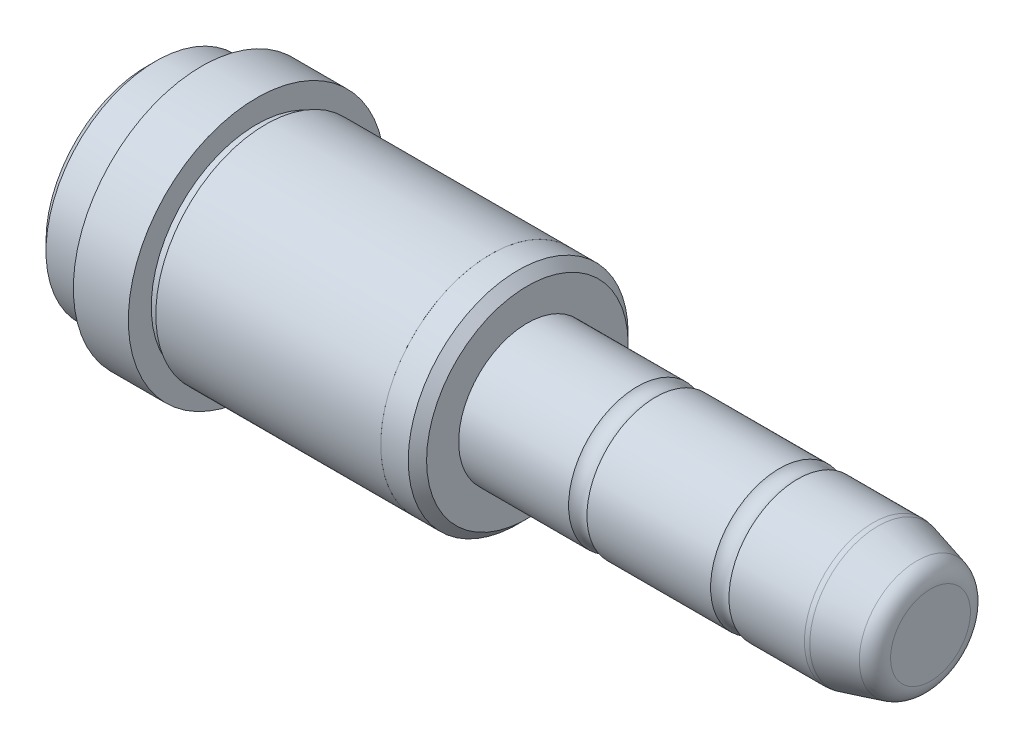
ISO-10303-21;
HEADER;
FILE_DESCRIPTION(('STEP AP214'),'2;1');
FILE_NAME('part.step','',(''),(''),'','','');
FILE_SCHEMA(('AUTOMOTIVE_DESIGN { 1 0 10303 214 1 1 1 1 }'));
ENDSEC;
DATA;
#1=APPLICATION_CONTEXT('core data for automotive mechanical design processes');
#2=APPLICATION_PROTOCOL_DEFINITION('international standard','automotive_design',2000,#1);
#3=PRODUCT_CONTEXT('',#1,'mechanical');
#4=PRODUCT('Part','Part','',(#3));
#5=PRODUCT_RELATED_PRODUCT_CATEGORY('part','',(#4));
#6=PRODUCT_DEFINITION_FORMATION('','',#4);
#7=PRODUCT_DEFINITION_CONTEXT('part definition',#1,'design');
#8=PRODUCT_DEFINITION('design','',#6,#7);
#9=PRODUCT_DEFINITION_SHAPE('','',#8);
#10=(LENGTH_UNIT() NAMED_UNIT(*) SI_UNIT(.MILLI.,.METRE.));
#11=(NAMED_UNIT(*) PLANE_ANGLE_UNIT() SI_UNIT($,.RADIAN.));
#12=(NAMED_UNIT(*) SI_UNIT($,.STERADIAN.) SOLID_ANGLE_UNIT());
#13=UNCERTAINTY_MEASURE_WITH_UNIT(LENGTH_MEASURE(1.E-05),#10,'distance_accuracy_value','');
#14=(GEOMETRIC_REPRESENTATION_CONTEXT(3) GLOBAL_UNCERTAINTY_ASSIGNED_CONTEXT((#13)) GLOBAL_UNIT_ASSIGNED_CONTEXT((#10,
#11,#12)) REPRESENTATION_CONTEXT('',''));
#15=CARTESIAN_POINT('',(0.,0.,0.));
#16=DIRECTION('',(0.,0.,1.));
#17=DIRECTION('',(1.,0.,0.));
#18=AXIS2_PLACEMENT_3D('',#15,#16,#17);
#19=CARTESIAN_POINT('',(85.55,2.17882543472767,0.));
#20=DIRECTION('',(1.,0.,0.));
#21=DIRECTION('',(0.,0.,-1.));
#22=AXIS2_PLACEMENT_3D('',#19,#20,#21);
#23=PLANE('',#22);
#24=CARTESIAN_POINT('',(85.55,0.,0.));
#25=DIRECTION('',(-1.,0.,0.));
#26=DIRECTION('',(0.,1.,0.));
#27=AXIS2_PLACEMENT_3D('',#24,#25,#26);
#28=CIRCLE('',#27,4.35765086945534);
#29=CARTESIAN_POINT('',(85.55,4.35765086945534,0.));
#30=VERTEX_POINT('',#29);
#31=EDGE_CURVE('E128',#30,#30,#28,.T.);
#32=ORIENTED_EDGE('',*,*,#31,.F.);
#33=EDGE_LOOP('',(#32));
#34=FACE_BOUND('',#33,.T.);
#35=ADVANCED_FACE('F15',(#34),#23,.T.);
#36=CARTESIAN_POINT('',(83.55,0.,0.));
#37=DIRECTION('',(1.,0.,0.));
#38=DIRECTION('',(0.,0.,-1.));
#39=AXIS2_PLACEMENT_3D('',#36,#37,#38);
#40=TOROIDAL_SURFACE('',#39,4.35765086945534,2.);
#41=CARTESIAN_POINT('',(84.0676380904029,0.,0.));
#42=DIRECTION('',(-1.,0.,0.));
#43=DIRECTION('',(0.,1.,0.));
#44=AXIS2_PLACEMENT_3D('',#41,#42,#43);
#45=CIRCLE('',#44,6.28950252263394);
#46=CARTESIAN_POINT('',(84.0676380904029,6.28950252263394,0.));
#47=VERTEX_POINT('',#46);
#48=EDGE_CURVE('E123',#47,#47,#45,.T.);
#49=ORIENTED_EDGE('',*,*,#48,.F.);
#50=EDGE_LOOP('',(#49));
#51=FACE_BOUND('',#50,.T.);
#52=ORIENTED_EDGE('',*,*,#31,.T.);
#53=EDGE_LOOP('',(#52));
#54=FACE_BOUND('',#53,.T.);
#55=ADVANCED_FACE('F135',(#51,#54),#40,.T.);
#56=CARTESIAN_POINT('',(79.8043330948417,0.,0.));
#57=DIRECTION('',(-1.,0.,0.));
#58=DIRECTION('',(0.,0.,1.));
#59=AXIS2_PLACEMENT_3D('',#56,#57,#58);
#60=CONICAL_SURFACE('',#59,7.43185165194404,0.261799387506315);
#61=CARTESIAN_POINT('',(79.8043330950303,0.,0.));
#62=DIRECTION('',(1.,0.,0.));
#63=DIRECTION('',(0.,0.,-1.));
#64=AXIS2_PLACEMENT_3D('',#61,#62,#63);
#65=CIRCLE('',#64,7.43185165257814);
#66=CARTESIAN_POINT('',(79.8043330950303,0.,-7.43185165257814));
#67=VERTEX_POINT('',#66);
#68=EDGE_CURVE('E119',#67,#67,#65,.F.);
#69=ORIENTED_EDGE('',*,*,#68,.F.);
#70=EDGE_LOOP('',(#69));
#71=FACE_BOUND('',#70,.T.);
#72=ORIENTED_EDGE('',*,*,#48,.T.);
#73=EDGE_LOOP('',(#72));
#74=FACE_BOUND('',#73,.T.);
#75=ADVANCED_FACE('F112',(#71,#74),#60,.T.);
#76=CARTESIAN_POINT('',(79.2866950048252,0.,0.));
#77=DIRECTION('',(1.,0.,0.));
#78=DIRECTION('',(0.,0.,-1.));
#79=AXIS2_PLACEMENT_3D('',#76,#77,#78);
#80=TOROIDAL_SURFACE('',#79,5.5,2.);
#81=CARTESIAN_POINT('',(79.2866950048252,0.,0.));
#82=DIRECTION('',(1.,0.,0.));
#83=DIRECTION('',(0.,0.,-1.));
#84=AXIS2_PLACEMENT_3D('',#81,#82,#83);
#85=CIRCLE('',#84,7.5);
#86=CARTESIAN_POINT('',(79.2866950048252,0.,-7.5));
#87=VERTEX_POINT('',#86);
#88=EDGE_CURVE('E122',#87,#87,#85,.F.);
#89=ORIENTED_EDGE('',*,*,#88,.F.);
#90=EDGE_LOOP('',(#89));
#91=FACE_BOUND('',#90,.T.);
#92=ORIENTED_EDGE('',*,*,#68,.T.);
#93=EDGE_LOOP('',(#92));
#94=FACE_BOUND('',#93,.T.);
#95=ADVANCED_FACE('F107',(#91,#94),#80,.T.);
#96=CARTESIAN_POINT('',(0.,5.492375,0.));
#97=DIRECTION('',(-1.,0.,0.));
#98=DIRECTION('',(0.,0.,1.));
#99=AXIS2_PLACEMENT_3D('',#96,#97,#98);
#100=PLANE('',#99);
#101=CARTESIAN_POINT('',(-4.48723089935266E-10,0.,0.));
#102=DIRECTION('',(1.,0.,0.));
#103=DIRECTION('',(0.,0.,-1.));
#104=AXIS2_PLACEMENT_3D('',#101,#102,#103);
#105=CIRCLE('',#104,10.9847500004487);
#106=CARTESIAN_POINT('',(-4.48723089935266E-10,0.,-10.9847500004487));
#107=VERTEX_POINT('',#106);
#108=EDGE_CURVE('E19',#107,#107,#105,.T.);
#109=ORIENTED_EDGE('',*,*,#108,.F.);
#110=EDGE_LOOP('',(#109));
#111=FACE_BOUND('',#110,.T.);
#112=ADVANCED_FACE('F103',(#111),#100,.T.);
#113=CARTESIAN_POINT('',(75.1683475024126,0.,0.));
#114=DIRECTION('',(1.,0.,0.));
#115=DIRECTION('',(0.,0.,-1.));
#116=AXIS2_PLACEMENT_3D('',#113,#114,#115);
#117=CYLINDRICAL_SURFACE('',#116,7.5);
#118=CARTESIAN_POINT('',(71.05,0.,0.));
#119=DIRECTION('',(1.,0.,0.));
#120=DIRECTION('',(0.,0.,-1.));
#121=AXIS2_PLACEMENT_3D('',#118,#119,#120);
#122=CIRCLE('',#121,7.50000000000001);
#123=CARTESIAN_POINT('',(71.05,0.,-7.50000000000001));
#124=VERTEX_POINT('',#123);
#125=EDGE_CURVE('E76',#124,#124,#122,.T.);
#126=ORIENTED_EDGE('',*,*,#125,.T.);
#127=EDGE_LOOP('',(#126));
#128=FACE_BOUND('',#127,.T.);
#129=ORIENTED_EDGE('',*,*,#88,.T.);
#130=EDGE_LOOP('',(#129));
#131=FACE_BOUND('',#130,.T.);
#132=ADVANCED_FACE('F99',(#128,#131),#117,.T.);
#133=CARTESIAN_POINT('',(1.00000000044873,0.,0.));
#134=DIRECTION('',(1.,0.,0.));
#135=DIRECTION('',(0.,0.,-1.));
#136=AXIS2_PLACEMENT_3D('',#133,#134,#135);
#137=CONICAL_SURFACE('',#136,11.9847499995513,0.785398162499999);
#138=ORIENTED_EDGE('',*,*,#108,.T.);
#139=EDGE_LOOP('',(#138));
#140=FACE_BOUND('',#139,.T.);
#141=CARTESIAN_POINT('',(1.,0.,0.));
#142=DIRECTION('',(1.,0.,0.));
#143=DIRECTION('',(0.,0.,-1.));
#144=AXIS2_PLACEMENT_3D('',#141,#142,#143);
#145=CIRCLE('',#144,11.98475);
#146=CARTESIAN_POINT('',(1.,0.,-11.98475));
#147=VERTEX_POINT('',#146);
#148=EDGE_CURVE('E71',#147,#147,#145,.T.);
#149=ORIENTED_EDGE('',*,*,#148,.F.);
#150=EDGE_LOOP('',(#149));
#151=FACE_BOUND('',#150,.T.);
#152=ADVANCED_FACE('F94',(#140,#151),#137,.T.);
#153=CARTESIAN_POINT('',(70.05,0.,0.));
#154=DIRECTION('',(1.,0.,0.));
#155=DIRECTION('',(0.,0.,-1.));
#156=AXIS2_PLACEMENT_3D('',#153,#154,#155);
#157=TOROIDAL_SURFACE('',#156,8.6180339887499,1.5);
#158=CARTESIAN_POINT('',(69.05,0.,0.));
#159=DIRECTION('',(1.,0.,0.));
#160=DIRECTION('',(0.,0.,-1.));
#161=AXIS2_PLACEMENT_3D('',#158,#159,#160);
#162=CIRCLE('',#161,7.5);
#163=CARTESIAN_POINT('',(69.05,0.,-7.5));
#164=VERTEX_POINT('',#163);
#165=EDGE_CURVE('E65',#164,#164,#162,.F.);
#166=ORIENTED_EDGE('',*,*,#165,.F.);
#167=EDGE_LOOP('',(#166));
#168=FACE_BOUND('',#167,.T.);
#169=ORIENTED_EDGE('',*,*,#125,.F.);
#170=EDGE_LOOP('',(#169));
#171=FACE_BOUND('',#170,.T.);
#172=ADVANCED_FACE('F89',(#168,#171),#157,.F.);
#173=CARTESIAN_POINT('',(3.,0.,0.));
#174=DIRECTION('',(1.,0.,0.));
#175=DIRECTION('',(0.,0.,-1.));
#176=AXIS2_PLACEMENT_3D('',#173,#174,#175);
#177=CYLINDRICAL_SURFACE('',#176,11.98475);
#178=ORIENTED_EDGE('',*,*,#148,.T.);
#179=EDGE_LOOP('',(#178));
#180=FACE_BOUND('',#179,.T.);
#181=CARTESIAN_POINT('',(5.,0.,0.));
#182=DIRECTION('',(1.,0.,0.));
#183=DIRECTION('',(0.,0.,-1.));
#184=AXIS2_PLACEMENT_3D('',#181,#182,#183);
#185=CIRCLE('',#184,11.98475);
#186=CARTESIAN_POINT('',(5.,0.,-11.98475));
#187=VERTEX_POINT('',#186);
#188=EDGE_CURVE('E63',#187,#187,#185,.T.);
#189=ORIENTED_EDGE('',*,*,#188,.F.);
#190=EDGE_LOOP('',(#189));
#191=FACE_BOUND('',#190,.T.);
#192=ADVANCED_FACE('F93',(#180,#191),#177,.T.);
#193=CARTESIAN_POINT('',(62.3,0.,0.));
#194=DIRECTION('',(1.,0.,0.));
#195=DIRECTION('',(0.,0.,-1.));
#196=AXIS2_PLACEMENT_3D('',#193,#194,#195);
#197=CYLINDRICAL_SURFACE('',#196,7.5);
#198=CARTESIAN_POINT('',(55.55,0.,0.));
#199=DIRECTION('',(1.,0.,0.));
#200=DIRECTION('',(0.,0.,-1.));
#201=AXIS2_PLACEMENT_3D('',#198,#199,#200);
#202=CIRCLE('',#201,7.5);
#203=CARTESIAN_POINT('',(55.55,0.,-7.5));
#204=VERTEX_POINT('',#203);
#205=EDGE_CURVE('E62',#204,#204,#202,.T.);
#206=ORIENTED_EDGE('',*,*,#205,.T.);
#207=EDGE_LOOP('',(#206));
#208=FACE_BOUND('',#207,.T.);
#209=ORIENTED_EDGE('',*,*,#165,.T.);
#210=EDGE_LOOP('',(#209));
#211=FACE_BOUND('',#210,.T.);
#212=ADVANCED_FACE('F224',(#208,#211),#197,.T.);
#213=CARTESIAN_POINT('',(5.,11.742375,0.));
#214=DIRECTION('',(1.,0.,0.));
#215=DIRECTION('',(0.,0.,-1.));
#216=AXIS2_PLACEMENT_3D('',#213,#214,#215);
#217=PLANE('',#216);
#218=CARTESIAN_POINT('',(5.,0.,0.));
#219=DIRECTION('',(1.,0.,0.));
#220=DIRECTION('',(0.,0.,-1.));
#221=AXIS2_PLACEMENT_3D('',#218,#219,#220);
#222=CIRCLE('',#221,11.5);
#223=CARTESIAN_POINT('',(5.,0.,-11.5));
#224=VERTEX_POINT('',#223);
#225=EDGE_CURVE('E60',#224,#224,#222,.T.);
#226=ORIENTED_EDGE('',*,*,#225,.F.);
#227=EDGE_LOOP('',(#226));
#228=FACE_BOUND('',#227,.T.);
#229=ORIENTED_EDGE('',*,*,#188,.T.);
#230=EDGE_LOOP('',(#229));
#231=FACE_BOUND('',#230,.T.);
#232=ADVANCED_FACE('F203',(#228,#231),#217,.T.);
#233=CARTESIAN_POINT('',(54.55,0.,0.));
#234=DIRECTION('',(1.,0.,0.));
#235=DIRECTION('',(0.,0.,-1.));
#236=AXIS2_PLACEMENT_3D('',#233,#234,#235);
#237=TOROIDAL_SURFACE('',#236,8.6180339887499,1.5);
#238=CARTESIAN_POINT('',(53.55,0.,0.));
#239=DIRECTION('',(1.,0.,0.));
#240=DIRECTION('',(0.,0.,-1.));
#241=AXIS2_PLACEMENT_3D('',#238,#239,#240);
#242=CIRCLE('',#241,7.5);
#243=CARTESIAN_POINT('',(53.55,0.,-7.5));
#244=VERTEX_POINT('',#243);
#245=EDGE_CURVE('E59',#244,#244,#242,.F.);
#246=ORIENTED_EDGE('',*,*,#245,.F.);
#247=EDGE_LOOP('',(#246));
#248=FACE_BOUND('',#247,.T.);
#249=ORIENTED_EDGE('',*,*,#205,.F.);
#250=EDGE_LOOP('',(#249));
#251=FACE_BOUND('',#250,.T.);
#252=ADVANCED_FACE('F198',(#248,#251),#237,.F.);
#253=CARTESIAN_POINT('',(5.5,0.,0.));
#254=DIRECTION('',(1.,0.,0.));
#255=DIRECTION('',(0.,0.,-1.));
#256=AXIS2_PLACEMENT_3D('',#253,#254,#255);
#257=CYLINDRICAL_SURFACE('',#256,11.5);
#258=ORIENTED_EDGE('',*,*,#225,.T.);
#259=EDGE_LOOP('',(#258));
#260=FACE_BOUND('',#259,.T.);
#261=CARTESIAN_POINT('',(6.,0.,0.));
#262=DIRECTION('',(1.,0.,0.));
#263=DIRECTION('',(0.,0.,-1.));
#264=AXIS2_PLACEMENT_3D('',#261,#262,#263);
#265=CIRCLE('',#264,11.5);
#266=CARTESIAN_POINT('',(6.,0.,-11.5));
#267=VERTEX_POINT('',#266);
#268=EDGE_CURVE('E56',#267,#267,#265,.T.);
#269=ORIENTED_EDGE('',*,*,#268,.F.);
#270=EDGE_LOOP('',(#269));
#271=FACE_BOUND('',#270,.T.);
#272=ADVANCED_FACE('F194',(#260,#271),#257,.T.);
#273=CARTESIAN_POINT('',(47.55,0.,0.));
#274=DIRECTION('',(1.,0.,0.));
#275=DIRECTION('',(0.,0.,-1.));
#276=AXIS2_PLACEMENT_3D('',#273,#274,#275);
#277=CYLINDRICAL_SURFACE('',#276,7.5);
#278=CARTESIAN_POINT('',(41.55,0.,0.));
#279=DIRECTION('',(1.,0.,0.));
#280=DIRECTION('',(0.,0.,-1.));
#281=AXIS2_PLACEMENT_3D('',#278,#279,#280);
#282=CIRCLE('',#281,7.5);
#283=CARTESIAN_POINT('',(41.55,0.,-7.5));
#284=VERTEX_POINT('',#283);
#285=EDGE_CURVE('E53',#284,#284,#282,.F.);
#286=ORIENTED_EDGE('',*,*,#285,.F.);
#287=EDGE_LOOP('',(#286));
#288=FACE_BOUND('',#287,.T.);
#289=ORIENTED_EDGE('',*,*,#245,.T.);
#290=EDGE_LOOP('',(#289));
#291=FACE_BOUND('',#290,.T.);
#292=ADVANCED_FACE('F190',(#288,#291),#277,.T.);
#293=CARTESIAN_POINT('',(6.,12.75,0.));
#294=DIRECTION('',(-1.,0.,0.));
#295=DIRECTION('',(0.,0.,1.));
#296=AXIS2_PLACEMENT_3D('',#293,#294,#295);
#297=PLANE('',#296);
#298=ORIENTED_EDGE('',*,*,#268,.T.);
#299=EDGE_LOOP('',(#298));
#300=FACE_BOUND('',#299,.T.);
#301=CARTESIAN_POINT('',(6.,0.,0.));
#302=DIRECTION('',(1.,0.,0.));
#303=DIRECTION('',(0.,0.,-1.));
#304=AXIS2_PLACEMENT_3D('',#301,#302,#303);
#305=CIRCLE('',#304,14.);
#306=CARTESIAN_POINT('',(6.,0.,-14.));
#307=VERTEX_POINT('',#306);
#308=EDGE_CURVE('E50',#307,#307,#305,.T.);
#309=ORIENTED_EDGE('',*,*,#308,.F.);
#310=EDGE_LOOP('',(#309));
#311=FACE_BOUND('',#310,.T.);
#312=ADVANCED_FACE('F186',(#300,#311),#297,.T.);
#313=CARTESIAN_POINT('',(41.55,9.25,0.));
#314=DIRECTION('',(1.,0.,0.));
#315=DIRECTION('',(0.,0.,-1.));
#316=AXIS2_PLACEMENT_3D('',#313,#314,#315);
#317=PLANE('',#316);
#318=ORIENTED_EDGE('',*,*,#285,.T.);
#319=EDGE_LOOP('',(#318));
#320=FACE_BOUND('',#319,.T.);
#321=CARTESIAN_POINT('',(41.5500000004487,0.,0.));
#322=DIRECTION('',(-1.,0.,0.));
#323=DIRECTION('',(0.,0.,1.));
#324=AXIS2_PLACEMENT_3D('',#321,#322,#323);
#325=CIRCLE('',#324,11.0000000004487);
#326=CARTESIAN_POINT('',(41.5500000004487,0.,11.0000000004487));
#327=VERTEX_POINT('',#326);
#328=EDGE_CURVE('E47',#327,#327,#325,.T.);
#329=ORIENTED_EDGE('',*,*,#328,.F.);
#330=EDGE_LOOP('',(#329));
#331=FACE_BOUND('',#330,.T.);
#332=ADVANCED_FACE('F182',(#320,#331),#317,.T.);
#333=CARTESIAN_POINT('',(9.,0.,0.));
#334=DIRECTION('',(1.,0.,0.));
#335=DIRECTION('',(0.,0.,-1.));
#336=AXIS2_PLACEMENT_3D('',#333,#334,#335);
#337=CYLINDRICAL_SURFACE('',#336,14.);
#338=ORIENTED_EDGE('',*,*,#308,.T.);
#339=EDGE_LOOP('',(#338));
#340=FACE_BOUND('',#339,.T.);
#341=CARTESIAN_POINT('',(12.,0.,0.));
#342=DIRECTION('',(1.,0.,0.));
#343=DIRECTION('',(0.,0.,-1.));
#344=AXIS2_PLACEMENT_3D('',#341,#342,#343);
#345=CIRCLE('',#344,14.);
#346=CARTESIAN_POINT('',(12.,0.,-14.));
#347=VERTEX_POINT('',#346);
#348=EDGE_CURVE('E44',#347,#347,#345,.T.);
#349=ORIENTED_EDGE('',*,*,#348,.F.);
#350=EDGE_LOOP('',(#349));
#351=FACE_BOUND('',#350,.T.);
#352=ADVANCED_FACE('F178',(#340,#351),#337,.T.);
#353=CARTESIAN_POINT('',(40.5499999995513,0.,0.));
#354=DIRECTION('',(-1.,0.,0.));
#355=DIRECTION('',(0.,0.,1.));
#356=AXIS2_PLACEMENT_3D('',#353,#354,#355);
#357=CONICAL_SURFACE('',#356,11.9999999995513,0.785398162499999);
#358=CARTESIAN_POINT('',(40.55,0.,0.));
#359=DIRECTION('',(1.,0.,0.));
#360=DIRECTION('',(0.,0.,-1.));
#361=AXIS2_PLACEMENT_3D('',#358,#359,#360);
#362=CIRCLE('',#361,12.);
#363=CARTESIAN_POINT('',(40.55,0.,-12.));
#364=VERTEX_POINT('',#363);
#365=EDGE_CURVE('E43',#364,#364,#362,.F.);
#366=ORIENTED_EDGE('',*,*,#365,.F.);
#367=EDGE_LOOP('',(#366));
#368=FACE_BOUND('',#367,.T.);
#369=ORIENTED_EDGE('',*,*,#328,.T.);
#370=EDGE_LOOP('',(#369));
#371=FACE_BOUND('',#370,.T.);
#372=ADVANCED_FACE('F174',(#368,#371),#357,.T.);
#373=CARTESIAN_POINT('',(12.,12.75,0.));
#374=DIRECTION('',(1.,0.,0.));
#375=DIRECTION('',(0.,0.,-1.));
#376=AXIS2_PLACEMENT_3D('',#373,#374,#375);
#377=PLANE('',#376);
#378=CARTESIAN_POINT('',(12.,0.,0.));
#379=DIRECTION('',(1.,0.,0.));
#380=DIRECTION('',(0.,0.,-1.));
#381=AXIS2_PLACEMENT_3D('',#378,#379,#380);
#382=CIRCLE('',#381,11.5);
#383=CARTESIAN_POINT('',(12.,0.,-11.5));
#384=VERTEX_POINT('',#383);
#385=EDGE_CURVE('E40',#384,#384,#382,.T.);
#386=ORIENTED_EDGE('',*,*,#385,.F.);
#387=EDGE_LOOP('',(#386));
#388=FACE_BOUND('',#387,.T.);
#389=ORIENTED_EDGE('',*,*,#348,.T.);
#390=EDGE_LOOP('',(#389));
#391=FACE_BOUND('',#390,.T.);
#392=ADVANCED_FACE('F170',(#388,#391),#377,.T.);
#393=CARTESIAN_POINT('',(39.05,0.,0.));
#394=DIRECTION('',(1.,0.,0.));
#395=DIRECTION('',(0.,0.,-1.));
#396=AXIS2_PLACEMENT_3D('',#393,#394,#395);
#397=CYLINDRICAL_SURFACE('',#396,12.);
#398=CARTESIAN_POINT('',(37.55,0.,0.));
#399=DIRECTION('',(1.,0.,0.));
#400=DIRECTION('',(0.,0.,-1.));
#401=AXIS2_PLACEMENT_3D('',#398,#399,#400);
#402=CIRCLE('',#401,12.);
#403=CARTESIAN_POINT('',(37.55,0.,-12.));
#404=VERTEX_POINT('',#403);
#405=EDGE_CURVE('E37',#404,#404,#402,.F.);
#406=ORIENTED_EDGE('',*,*,#405,.F.);
#407=EDGE_LOOP('',(#406));
#408=FACE_BOUND('',#407,.T.);
#409=ORIENTED_EDGE('',*,*,#365,.T.);
#410=EDGE_LOOP('',(#409));
#411=FACE_BOUND('',#410,.T.);
#412=ADVANCED_FACE('F166',(#408,#411),#397,.T.);
#413=CARTESIAN_POINT('',(12.5,0.,0.));
#414=DIRECTION('',(1.,0.,0.));
#415=DIRECTION('',(0.,0.,-1.));
#416=AXIS2_PLACEMENT_3D('',#413,#414,#415);
#417=CYLINDRICAL_SURFACE('',#416,11.5);
#418=ORIENTED_EDGE('',*,*,#385,.T.);
#419=EDGE_LOOP('',(#418));
#420=FACE_BOUND('',#419,.T.);
#421=CARTESIAN_POINT('',(13.,0.,0.));
#422=DIRECTION('',(1.,0.,0.));
#423=DIRECTION('',(0.,0.,-1.));
#424=AXIS2_PLACEMENT_3D('',#421,#422,#423);
#425=CIRCLE('',#424,11.5);
#426=CARTESIAN_POINT('',(13.,0.,-11.5));
#427=VERTEX_POINT('',#426);
#428=EDGE_CURVE('E28',#427,#427,#425,.T.);
#429=ORIENTED_EDGE('',*,*,#428,.F.);
#430=EDGE_LOOP('',(#429));
#431=FACE_BOUND('',#430,.T.);
#432=ADVANCED_FACE('F162',(#420,#431),#417,.T.);
#433=CARTESIAN_POINT('',(37.55,12.002125,0.));
#434=DIRECTION('',(1.,0.,0.));
#435=DIRECTION('',(0.,0.,-1.));
#436=AXIS2_PLACEMENT_3D('',#433,#434,#435);
#437=PLANE('',#436);
#438=ORIENTED_EDGE('',*,*,#405,.T.);
#439=EDGE_LOOP('',(#438));
#440=FACE_BOUND('',#439,.T.);
#441=CARTESIAN_POINT('',(37.55,0.,0.));
#442=DIRECTION('',(1.,0.,0.));
#443=DIRECTION('',(0.,0.,-1.));
#444=AXIS2_PLACEMENT_3D('',#441,#442,#443);
#445=CIRCLE('',#444,12.00425);
#446=CARTESIAN_POINT('',(37.55,0.,-12.00425));
#447=VERTEX_POINT('',#446);
#448=EDGE_CURVE('E23',#447,#447,#445,.F.);
#449=ORIENTED_EDGE('',*,*,#448,.F.);
#450=EDGE_LOOP('',(#449));
#451=FACE_BOUND('',#450,.T.);
#452=ADVANCED_FACE('F155',(#440,#451),#437,.T.);
#453=CARTESIAN_POINT('',(13.,11.752125,0.));
#454=DIRECTION('',(-1.,0.,0.));
#455=DIRECTION('',(0.,0.,1.));
#456=AXIS2_PLACEMENT_3D('',#453,#454,#455);
#457=PLANE('',#456);
#458=ORIENTED_EDGE('',*,*,#428,.T.);
#459=EDGE_LOOP('',(#458));
#460=FACE_BOUND('',#459,.T.);
#461=CARTESIAN_POINT('',(13.,0.,0.));
#462=DIRECTION('',(1.,0.,0.));
#463=DIRECTION('',(0.,0.,-1.));
#464=AXIS2_PLACEMENT_3D('',#461,#462,#463);
#465=CIRCLE('',#464,12.00425);
#466=CARTESIAN_POINT('',(13.,0.,-12.00425));
#467=VERTEX_POINT('',#466);
#468=EDGE_CURVE('E10',#467,#467,#465,.T.);
#469=ORIENTED_EDGE('',*,*,#468,.F.);
#470=EDGE_LOOP('',(#469));
#471=FACE_BOUND('',#470,.T.);
#472=ADVANCED_FACE('F150',(#460,#471),#457,.T.);
#473=CARTESIAN_POINT('',(25.275,0.,0.));
#474=DIRECTION('',(1.,0.,0.));
#475=DIRECTION('',(0.,0.,-1.));
#476=AXIS2_PLACEMENT_3D('',#473,#474,#475);
#477=CYLINDRICAL_SURFACE('',#476,12.00425);
#478=ORIENTED_EDGE('',*,*,#468,.T.);
#479=EDGE_LOOP('',(#478));
#480=FACE_BOUND('',#479,.T.);
#481=ORIENTED_EDGE('',*,*,#448,.T.);
#482=EDGE_LOOP('',(#481));
#483=FACE_BOUND('',#482,.T.);
#484=ADVANCED_FACE('F148',(#480,#483),#477,.T.);
#485=CLOSED_SHELL('',(#35,#55,#75,#95,#112,#132,#152,#172,#192,#212,#232,#252,#272,#292,#312,
#332,#352,#372,#392,#412,#432,#452,#472,#484));
#486=MANIFOLD_SOLID_BREP('B1',#485);
#487=ADVANCED_BREP_SHAPE_REPRESENTATION('',(#18,#486),#14);
#488=SHAPE_DEFINITION_REPRESENTATION(#9,#487);
ENDSEC;
END-ISO-10303-21;
